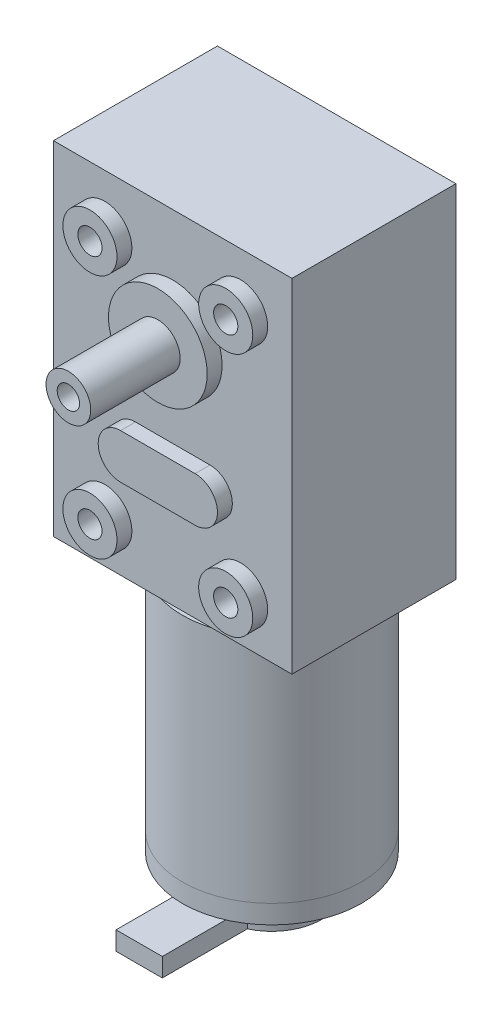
ISO-10303-21;
HEADER;
FILE_DESCRIPTION(('STEP AP214'),'2;1');
FILE_NAME('part.step','',(''),(''),'','','');
FILE_SCHEMA(('AUTOMOTIVE_DESIGN { 1 0 10303 214 1 1 1 1 }'));
ENDSEC;
DATA;
#1=APPLICATION_CONTEXT('core data for automotive mechanical design processes');
#2=APPLICATION_PROTOCOL_DEFINITION('international standard','automotive_design',2000,#1);
#3=PRODUCT_CONTEXT('',#1,'mechanical');
#4=PRODUCT('Part','Part','',(#3));
#5=PRODUCT_RELATED_PRODUCT_CATEGORY('part','',(#4));
#6=PRODUCT_DEFINITION_FORMATION('','',#4);
#7=PRODUCT_DEFINITION_CONTEXT('part definition',#1,'design');
#8=PRODUCT_DEFINITION('design','',#6,#7);
#9=PRODUCT_DEFINITION_SHAPE('','',#8);
#10=(LENGTH_UNIT() NAMED_UNIT(*) SI_UNIT(.MILLI.,.METRE.));
#11=(NAMED_UNIT(*) PLANE_ANGLE_UNIT() SI_UNIT($,.RADIAN.));
#12=(NAMED_UNIT(*) SI_UNIT($,.STERADIAN.) SOLID_ANGLE_UNIT());
#13=UNCERTAINTY_MEASURE_WITH_UNIT(LENGTH_MEASURE(1.E-05),#10,'distance_accuracy_value','');
#14=(GEOMETRIC_REPRESENTATION_CONTEXT(3) GLOBAL_UNCERTAINTY_ASSIGNED_CONTEXT((#13)) GLOBAL_UNIT_ASSIGNED_CONTEXT((#10,
#11,#12)) REPRESENTATION_CONTEXT('',''));
#15=CARTESIAN_POINT('',(0.,0.,0.));
#16=DIRECTION('',(0.,0.,1.));
#17=DIRECTION('',(1.,0.,0.));
#18=AXIS2_PLACEMENT_3D('',#15,#16,#17);
#19=CARTESIAN_POINT('',(0.,-61.,-6.));
#20=DIRECTION('',(0.,-1.,0.));
#21=DIRECTION('',(0.,0.,-1.));
#22=AXIS2_PLACEMENT_3D('',#19,#20,#21);
#23=PLANE('',#22);
#24=DIRECTION('',(0.,0.,1.));
#25=VECTOR('',#24,1.);
#26=CARTESIAN_POINT('',(4.6,-61.,-6.));
#27=LINE('',#26,#25);
#28=CARTESIAN_POINT('',(4.6,-61.,-6.));
#29=VERTEX_POINT('',#28);
#30=CARTESIAN_POINT('',(4.6,-61.,6.));
#31=VERTEX_POINT('',#30);
#32=EDGE_CURVE('E285',#29,#31,#27,.T.);
#33=ORIENTED_EDGE('',*,*,#32,.T.);
#34=DIRECTION('',(1.,0.,0.));
#35=VECTOR('',#34,1.);
#36=CARTESIAN_POINT('',(0.,-61.,6.));
#37=LINE('',#36,#35);
#38=CARTESIAN_POINT('',(-1.6,-61.,6.));
#39=VERTEX_POINT('',#38);
#40=EDGE_CURVE('E322',#39,#31,#37,.T.);
#41=ORIENTED_EDGE('',*,*,#40,.F.);
#42=DIRECTION('',(0.,0.,1.));
#43=VECTOR('',#42,1.);
#44=CARTESIAN_POINT('',(-1.6,-61.,-6.));
#45=LINE('',#44,#43);
#46=CARTESIAN_POINT('',(-1.6,-61.,-6.));
#47=VERTEX_POINT('',#46);
#48=EDGE_CURVE('E13',#47,#39,#45,.T.);
#49=ORIENTED_EDGE('',*,*,#48,.F.);
#50=DIRECTION('',(1.,0.,0.));
#51=VECTOR('',#50,1.);
#52=CARTESIAN_POINT('',(0.,-61.,-6.));
#53=LINE('',#52,#51);
#54=EDGE_CURVE('E324',#47,#29,#53,.T.);
#55=ORIENTED_EDGE('',*,*,#54,.T.);
#56=EDGE_LOOP('',(#33,#41,#49,#55));
#57=FACE_BOUND('',#56,.T.);
#58=ADVANCED_FACE('F282',(#57),#23,.T.);
#59=CARTESIAN_POINT('',(-1.6,0.,-6.));
#60=DIRECTION('',(1.,0.,0.));
#61=DIRECTION('',(0.,0.,-1.));
#62=AXIS2_PLACEMENT_3D('',#59,#60,#61);
#63=PLANE('',#62);
#64=ORIENTED_EDGE('',*,*,#48,.T.);
#65=DIRECTION('',(0.,1.,0.));
#66=VECTOR('',#65,1.);
#67=CARTESIAN_POINT('',(-1.6,0.,6.));
#68=LINE('',#67,#66);
#69=CARTESIAN_POINT('',(-1.6,-58.5,6.));
#70=VERTEX_POINT('',#69);
#71=EDGE_CURVE('E340',#39,#70,#68,.T.);
#72=ORIENTED_EDGE('',*,*,#71,.T.);
#73=DIRECTION('',(0.,0.,1.));
#74=VECTOR('',#73,1.);
#75=CARTESIAN_POINT('',(-1.6,-58.5,-6.));
#76=LINE('',#75,#74);
#77=CARTESIAN_POINT('',(-1.6,-58.5,-6.));
#78=VERTEX_POINT('',#77);
#79=EDGE_CURVE('E290',#78,#70,#76,.T.);
#80=ORIENTED_EDGE('',*,*,#79,.F.);
#81=DIRECTION('',(0.,1.,0.));
#82=VECTOR('',#81,1.);
#83=CARTESIAN_POINT('',(-1.6,0.,-6.));
#84=LINE('',#83,#82);
#85=EDGE_CURVE('E303',#47,#78,#84,.T.);
#86=ORIENTED_EDGE('',*,*,#85,.F.);
#87=EDGE_LOOP('',(#64,#72,#80,#86));
#88=FACE_BOUND('',#87,.T.);
#89=ADVANCED_FACE('F355',(#88),#63,.F.);
#90=CARTESIAN_POINT('',(0.,-58.5,-6.));
#91=DIRECTION('',(0.,-1.,0.));
#92=DIRECTION('',(0.,0.,-1.));
#93=AXIS2_PLACEMENT_3D('',#90,#91,#92);
#94=PLANE('',#93);
#95=ORIENTED_EDGE('',*,*,#79,.T.);
#96=DIRECTION('',(1.,0.,0.));
#97=VECTOR('',#96,1.);
#98=CARTESIAN_POINT('',(0.,-58.5,6.));
#99=LINE('',#98,#97);
#100=CARTESIAN_POINT('',(4.6,-58.5,6.));
#101=VERTEX_POINT('',#100);
#102=EDGE_CURVE('E336',#70,#101,#99,.T.);
#103=ORIENTED_EDGE('',*,*,#102,.T.);
#104=DIRECTION('',(0.,0.,1.));
#105=VECTOR('',#104,1.);
#106=CARTESIAN_POINT('',(4.6,-58.5,-6.));
#107=LINE('',#106,#105);
#108=CARTESIAN_POINT('',(4.6,-58.5,-6.));
#109=VERTEX_POINT('',#108);
#110=EDGE_CURVE('E328',#109,#101,#107,.T.);
#111=ORIENTED_EDGE('',*,*,#110,.F.);
#112=DIRECTION('',(1.,0.,0.));
#113=VECTOR('',#112,1.);
#114=CARTESIAN_POINT('',(0.,-58.5,-6.));
#115=LINE('',#114,#113);
#116=EDGE_CURVE('E348',#78,#109,#115,.T.);
#117=ORIENTED_EDGE('',*,*,#116,.F.);
#118=EDGE_LOOP('',(#95,#103,#111,#117));
#119=FACE_BOUND('',#118,.T.);
#120=ADVANCED_FACE('F353',(#119),#94,.F.);
#121=CARTESIAN_POINT('',(4.6,0.,-6.));
#122=DIRECTION('',(1.,0.,0.));
#123=DIRECTION('',(0.,0.,-1.));
#124=AXIS2_PLACEMENT_3D('',#121,#122,#123);
#125=PLANE('',#124);
#126=ORIENTED_EDGE('',*,*,#110,.T.);
#127=DIRECTION('',(0.,1.,0.));
#128=VECTOR('',#127,1.);
#129=CARTESIAN_POINT('',(4.6,0.,6.));
#130=LINE('',#129,#128);
#131=EDGE_CURVE('E330',#31,#101,#130,.T.);
#132=ORIENTED_EDGE('',*,*,#131,.F.);
#133=ORIENTED_EDGE('',*,*,#32,.F.);
#134=DIRECTION('',(0.,1.,0.));
#135=VECTOR('',#134,1.);
#136=CARTESIAN_POINT('',(4.6,0.,-6.));
#137=LINE('',#136,#135);
#138=EDGE_CURVE('E346',#29,#109,#137,.T.);
#139=ORIENTED_EDGE('',*,*,#138,.T.);
#140=EDGE_LOOP('',(#126,#132,#133,#139));
#141=FACE_BOUND('',#140,.T.);
#142=ADVANCED_FACE('F331',(#141),#125,.T.);
#143=CARTESIAN_POINT('',(0.,0.,-6.));
#144=DIRECTION('',(0.,0.,1.));
#145=DIRECTION('',(1.,0.,0.));
#146=AXIS2_PLACEMENT_3D('',#143,#144,#145);
#147=PLANE('',#146);
#148=ORIENTED_EDGE('',*,*,#54,.F.);
#149=ORIENTED_EDGE('',*,*,#85,.T.);
#150=ORIENTED_EDGE('',*,*,#116,.T.);
#151=ORIENTED_EDGE('',*,*,#138,.F.);
#152=EDGE_LOOP('',(#148,#149,#150,#151));
#153=FACE_BOUND('',#152,.T.);
#154=ADVANCED_FACE('F356',(#153),#147,.F.);
#155=CARTESIAN_POINT('',(0.,0.,6.));
#156=DIRECTION('',(0.,0.,1.));
#157=DIRECTION('',(1.,0.,0.));
#158=AXIS2_PLACEMENT_3D('',#155,#156,#157);
#159=PLANE('',#158);
#160=ORIENTED_EDGE('',*,*,#40,.T.);
#161=ORIENTED_EDGE('',*,*,#131,.T.);
#162=ORIENTED_EDGE('',*,*,#102,.F.);
#163=ORIENTED_EDGE('',*,*,#71,.F.);
#164=EDGE_LOOP('',(#160,#161,#162,#163));
#165=FACE_BOUND('',#164,.T.);
#166=ADVANCED_FACE('F338',(#165),#159,.T.);
#167=CLOSED_SHELL('',(#58,#89,#120,#142,#154,#166));
#168=MANIFOLD_SOLID_BREP('B2',#167);
#169=CARTESIAN_POINT('',(1.8,-61.,-11.5));
#170=DIRECTION('',(0.,1.,0.));
#171=DIRECTION('',(0.,0.,1.));
#172=AXIS2_PLACEMENT_3D('',#169,#170,#171);
#173=CYLINDRICAL_SURFACE('',#172,6.7);
#174=CARTESIAN_POINT('',(1.8,-58.5,-11.5));
#175=DIRECTION('',(0.,-1.,0.));
#176=DIRECTION('',(0.,0.,-1.));
#177=AXIS2_PLACEMENT_3D('',#174,#175,#176);
#178=CIRCLE('',#177,6.7);
#179=CARTESIAN_POINT('',(4.6,-58.5,-5.41312888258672));
#180=VERTEX_POINT('',#179);
#181=CARTESIAN_POINT('',(-1.6,-58.5,-5.72678599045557));
#182=VERTEX_POINT('',#181);
#183=EDGE_CURVE('E280',#180,#182,#178,.T.);
#184=ORIENTED_EDGE('',*,*,#183,.F.);
#185=DIRECTION('',(0.,1.,0.));
#186=VECTOR('',#185,1.);
#187=CARTESIAN_POINT('',(4.6,-61.,-5.41312888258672));
#188=LINE('',#187,#186);
#189=CARTESIAN_POINT('',(4.6,-61.,-5.41312888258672));
#190=VERTEX_POINT('',#189);
#191=EDGE_CURVE('E471',#180,#190,#188,.F.);
#192=ORIENTED_EDGE('',*,*,#191,.T.);
#193=CARTESIAN_POINT('',(1.8,-61.,-11.5));
#194=DIRECTION('',(0.,-1.,0.));
#195=DIRECTION('',(0.,0.,-1.));
#196=AXIS2_PLACEMENT_3D('',#193,#194,#195);
#197=CIRCLE('',#196,6.7);
#198=CARTESIAN_POINT('',(-1.6,-61.,-5.72678599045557));
#199=VERTEX_POINT('',#198);
#200=EDGE_CURVE('E456',#199,#190,#197,.T.);
#201=ORIENTED_EDGE('',*,*,#200,.F.);
#202=DIRECTION('',(0.,1.,0.));
#203=VECTOR('',#202,1.);
#204=CARTESIAN_POINT('',(-1.6,-61.,-5.72678599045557));
#205=LINE('',#204,#203);
#206=EDGE_CURVE('E512',#182,#199,#205,.F.);
#207=ORIENTED_EDGE('',*,*,#206,.F.);
#208=EDGE_LOOP('',(#184,#192,#201,#207));
#209=FACE_BOUND('',#208,.T.);
#210=CARTESIAN_POINT('',(1.8,-56.5,-11.5));
#211=DIRECTION('',(0.,-1.,0.));
#212=DIRECTION('',(0.,0.,-1.));
#213=AXIS2_PLACEMENT_3D('',#210,#211,#212);
#214=CIRCLE('',#213,6.7);
#215=CARTESIAN_POINT('',(1.8,-56.5,-18.2));
#216=VERTEX_POINT('',#215);
#217=EDGE_CURVE('E518',#216,#216,#214,.T.);
#218=ORIENTED_EDGE('',*,*,#217,.T.);
#219=EDGE_LOOP('',(#218));
#220=FACE_BOUND('',#219,.T.);
#221=ADVANCED_FACE('F449',(#209,#220),#173,.T.);
#222=CARTESIAN_POINT('',(1.8,-61.,-11.5));
#223=DIRECTION('',(0.,-1.,0.));
#224=DIRECTION('',(0.,0.,-1.));
#225=AXIS2_PLACEMENT_3D('',#222,#223,#224);
#226=PLANE('',#225);
#227=DIRECTION('',(0.,0.,1.));
#228=VECTOR('',#227,1.);
#229=CARTESIAN_POINT('',(4.6,-61.,-6.));
#230=LINE('',#229,#228);
#231=CARTESIAN_POINT('',(4.6,-61.,-6.));
#232=VERTEX_POINT('',#231);
#233=EDGE_CURVE('E513',#232,#190,#230,.T.);
#234=ORIENTED_EDGE('',*,*,#233,.F.);
#235=DIRECTION('',(1.,0.,0.));
#236=VECTOR('',#235,1.);
#237=CARTESIAN_POINT('',(0.,-61.,-6.));
#238=LINE('',#237,#236);
#239=CARTESIAN_POINT('',(-1.6,-61.,-6.));
#240=VERTEX_POINT('',#239);
#241=EDGE_CURVE('E495',#240,#232,#238,.T.);
#242=ORIENTED_EDGE('',*,*,#241,.F.);
#243=DIRECTION('',(0.,0.,1.));
#244=VECTOR('',#243,1.);
#245=CARTESIAN_POINT('',(-1.6,-61.,-6.));
#246=LINE('',#245,#244);
#247=EDGE_CURVE('E493',#240,#199,#246,.T.);
#248=ORIENTED_EDGE('',*,*,#247,.T.);
#249=ORIENTED_EDGE('',*,*,#200,.T.);
#250=EDGE_LOOP('',(#234,#242,#248,#249));
#251=FACE_BOUND('',#250,.T.);
#252=ADVANCED_FACE('F526',(#251),#226,.T.);
#253=CARTESIAN_POINT('',(1.8,-56.5,-11.5));
#254=DIRECTION('',(0.,-1.,0.));
#255=DIRECTION('',(0.,0.,-1.));
#256=AXIS2_PLACEMENT_3D('',#253,#254,#255);
#257=PLANE('',#256);
#258=ORIENTED_EDGE('',*,*,#217,.F.);
#259=EDGE_LOOP('',(#258));
#260=FACE_BOUND('',#259,.T.);
#261=ADVANCED_FACE('F524',(#260),#257,.F.);
#262=CARTESIAN_POINT('',(0.,-58.5,-6.));
#263=DIRECTION('',(0.,-1.,0.));
#264=DIRECTION('',(0.,0.,-1.));
#265=AXIS2_PLACEMENT_3D('',#262,#263,#264);
#266=PLANE('',#265);
#267=ORIENTED_EDGE('',*,*,#183,.T.);
#268=DIRECTION('',(0.,0.,1.));
#269=VECTOR('',#268,1.);
#270=CARTESIAN_POINT('',(-1.6,-58.5,-6.));
#271=LINE('',#270,#269);
#272=CARTESIAN_POINT('',(-1.6,-58.5,-6.));
#273=VERTEX_POINT('',#272);
#274=EDGE_CURVE('E490',#273,#182,#271,.T.);
#275=ORIENTED_EDGE('',*,*,#274,.F.);
#276=DIRECTION('',(1.,0.,0.));
#277=VECTOR('',#276,1.);
#278=CARTESIAN_POINT('',(0.,-58.5,-6.));
#279=LINE('',#278,#277);
#280=CARTESIAN_POINT('',(4.6,-58.5,-6.));
#281=VERTEX_POINT('',#280);
#282=EDGE_CURVE('E496',#273,#281,#279,.T.);
#283=ORIENTED_EDGE('',*,*,#282,.T.);
#284=DIRECTION('',(0.,0.,1.));
#285=VECTOR('',#284,1.);
#286=CARTESIAN_POINT('',(4.6,-58.5,-6.));
#287=LINE('',#286,#285);
#288=EDGE_CURVE('E510',#281,#180,#287,.T.);
#289=ORIENTED_EDGE('',*,*,#288,.T.);
#290=EDGE_LOOP('',(#267,#275,#283,#289));
#291=FACE_BOUND('',#290,.T.);
#292=ADVANCED_FACE('F499',(#291),#266,.T.);
#293=CARTESIAN_POINT('',(4.6,0.,-6.));
#294=DIRECTION('',(1.,0.,0.));
#295=DIRECTION('',(0.,0.,-1.));
#296=AXIS2_PLACEMENT_3D('',#293,#294,#295);
#297=PLANE('',#296);
#298=ORIENTED_EDGE('',*,*,#288,.F.);
#299=DIRECTION('',(0.,1.,0.));
#300=VECTOR('',#299,1.);
#301=CARTESIAN_POINT('',(4.6,0.,-6.));
#302=LINE('',#301,#300);
#303=EDGE_CURVE('E501',#232,#281,#302,.T.);
#304=ORIENTED_EDGE('',*,*,#303,.F.);
#305=ORIENTED_EDGE('',*,*,#233,.T.);
#306=ORIENTED_EDGE('',*,*,#191,.F.);
#307=EDGE_LOOP('',(#298,#304,#305,#306));
#308=FACE_BOUND('',#307,.T.);
#309=ADVANCED_FACE('F531',(#308),#297,.F.);
#310=CARTESIAN_POINT('',(-1.6,0.,-6.));
#311=DIRECTION('',(1.,0.,0.));
#312=DIRECTION('',(0.,0.,-1.));
#313=AXIS2_PLACEMENT_3D('',#310,#311,#312);
#314=PLANE('',#313);
#315=ORIENTED_EDGE('',*,*,#206,.T.);
#316=ORIENTED_EDGE('',*,*,#247,.F.);
#317=DIRECTION('',(0.,1.,0.));
#318=VECTOR('',#317,1.);
#319=CARTESIAN_POINT('',(-1.6,0.,-6.));
#320=LINE('',#319,#318);
#321=EDGE_CURVE('E463',#240,#273,#320,.T.);
#322=ORIENTED_EDGE('',*,*,#321,.T.);
#323=ORIENTED_EDGE('',*,*,#274,.T.);
#324=EDGE_LOOP('',(#315,#316,#322,#323));
#325=FACE_BOUND('',#324,.T.);
#326=ADVANCED_FACE('F489',(#325),#314,.T.);
#327=CARTESIAN_POINT('',(0.,0.,-6.));
#328=DIRECTION('',(0.,0.,1.));
#329=DIRECTION('',(1.,0.,0.));
#330=AXIS2_PLACEMENT_3D('',#327,#328,#329);
#331=PLANE('',#330);
#332=ORIENTED_EDGE('',*,*,#282,.F.);
#333=ORIENTED_EDGE('',*,*,#321,.F.);
#334=ORIENTED_EDGE('',*,*,#241,.T.);
#335=ORIENTED_EDGE('',*,*,#303,.T.);
#336=EDGE_LOOP('',(#332,#333,#334,#335));
#337=FACE_BOUND('',#336,.T.);
#338=ADVANCED_FACE('F504',(#337),#331,.T.);
#339=CLOSED_SHELL('',(#221,#252,#261,#292,#309,#326,#338));
#340=MANIFOLD_SOLID_BREP('B7',#339);
#341=CARTESIAN_POINT('',(1.8,-56.5,-11.5));
#342=DIRECTION('',(0.,1.,0.));
#343=DIRECTION('',(0.,0.,1.));
#344=AXIS2_PLACEMENT_3D('',#341,#342,#343);
#345=CYLINDRICAL_SURFACE('',#344,12.);
#346=CARTESIAN_POINT('',(1.8,-56.5,-11.5));
#347=DIRECTION('',(0.,-1.,0.));
#348=DIRECTION('',(0.,0.,-1.));
#349=AXIS2_PLACEMENT_3D('',#346,#347,#348);
#350=CIRCLE('',#349,12.);
#351=CARTESIAN_POINT('',(1.8,-56.5,-23.5));
#352=VERTEX_POINT('',#351);
#353=EDGE_CURVE('E448',#352,#352,#350,.T.);
#354=ORIENTED_EDGE('',*,*,#353,.F.);
#355=EDGE_LOOP('',(#354));
#356=FACE_BOUND('',#355,.T.);
#357=CARTESIAN_POINT('',(1.8,-54.,-11.5));
#358=DIRECTION('',(0.,-1.,0.));
#359=DIRECTION('',(0.,0.,-1.));
#360=AXIS2_PLACEMENT_3D('',#357,#358,#359);
#361=CIRCLE('',#360,12.);
#362=CARTESIAN_POINT('',(1.8,-54.,-23.5));
#363=VERTEX_POINT('',#362);
#364=EDGE_CURVE('E624',#363,#363,#361,.T.);
#365=ORIENTED_EDGE('',*,*,#364,.T.);
#366=EDGE_LOOP('',(#365));
#367=FACE_BOUND('',#366,.T.);
#368=ADVANCED_FACE('F621',(#356,#367),#345,.T.);
#369=CARTESIAN_POINT('',(1.8,-56.5,-11.5));
#370=DIRECTION('',(0.,-1.,0.));
#371=DIRECTION('',(0.,0.,-1.));
#372=AXIS2_PLACEMENT_3D('',#369,#370,#371);
#373=PLANE('',#372);
#374=ORIENTED_EDGE('',*,*,#353,.T.);
#375=EDGE_LOOP('',(#374));
#376=FACE_BOUND('',#375,.T.);
#377=ADVANCED_FACE('F636',(#376),#373,.T.);
#378=CARTESIAN_POINT('',(1.8,-54.,-11.5));
#379=DIRECTION('',(0.,-1.,0.));
#380=DIRECTION('',(0.,0.,-1.));
#381=AXIS2_PLACEMENT_3D('',#378,#379,#380);
#382=PLANE('',#381);
#383=ORIENTED_EDGE('',*,*,#364,.F.);
#384=EDGE_LOOP('',(#383));
#385=FACE_BOUND('',#384,.T.);
#386=ADVANCED_FACE('F634',(#385),#382,.F.);
#387=CLOSED_SHELL('',(#368,#377,#386));
#388=MANIFOLD_SOLID_BREP('B274',#387);
#389=CARTESIAN_POINT('',(1.8,-54.,-11.5));
#390=DIRECTION('',(0.,1.,0.));
#391=DIRECTION('',(0.,0.,1.));
#392=AXIS2_PLACEMENT_3D('',#389,#390,#391);
#393=CYLINDRICAL_SURFACE('',#392,12.);
#394=CARTESIAN_POINT('',(1.8,-54.,-11.5));
#395=DIRECTION('',(0.,-1.,0.));
#396=DIRECTION('',(0.,0.,-1.));
#397=AXIS2_PLACEMENT_3D('',#394,#395,#396);
#398=CIRCLE('',#397,12.);
#399=CARTESIAN_POINT('',(1.8,-54.,-23.5));
#400=VERTEX_POINT('',#399);
#401=EDGE_CURVE('E620',#400,#400,#398,.T.);
#402=ORIENTED_EDGE('',*,*,#401,.F.);
#403=EDGE_LOOP('',(#402));
#404=FACE_BOUND('',#403,.T.);
#405=CARTESIAN_POINT('',(1.8,-23.,-11.5));
#406=DIRECTION('',(0.,-1.,0.));
#407=DIRECTION('',(0.,0.,-1.));
#408=AXIS2_PLACEMENT_3D('',#405,#406,#407);
#409=CIRCLE('',#408,12.);
#410=CARTESIAN_POINT('',(1.8,-23.,-23.5));
#411=VERTEX_POINT('',#410);
#412=EDGE_CURVE('E679',#411,#411,#409,.T.);
#413=ORIENTED_EDGE('',*,*,#412,.T.);
#414=EDGE_LOOP('',(#413));
#415=FACE_BOUND('',#414,.T.);
#416=ADVANCED_FACE('F676',(#404,#415),#393,.T.);
#417=CARTESIAN_POINT('',(1.8,-54.,-11.5));
#418=DIRECTION('',(0.,-1.,0.));
#419=DIRECTION('',(0.,0.,-1.));
#420=AXIS2_PLACEMENT_3D('',#417,#418,#419);
#421=PLANE('',#420);
#422=ORIENTED_EDGE('',*,*,#401,.T.);
#423=EDGE_LOOP('',(#422));
#424=FACE_BOUND('',#423,.T.);
#425=ADVANCED_FACE('F691',(#424),#421,.T.);
#426=CARTESIAN_POINT('',(1.8,-23.,-11.5));
#427=DIRECTION('',(0.,-1.,0.));
#428=DIRECTION('',(0.,0.,-1.));
#429=AXIS2_PLACEMENT_3D('',#426,#427,#428);
#430=PLANE('',#429);
#431=ORIENTED_EDGE('',*,*,#412,.F.);
#432=EDGE_LOOP('',(#431));
#433=FACE_BOUND('',#432,.T.);
#434=ADVANCED_FACE('F689',(#433),#430,.F.);
#435=CLOSED_SHELL('',(#416,#425,#434));
#436=MANIFOLD_SOLID_BREP('B443',#435);
#437=CARTESIAN_POINT('',(9.11,15.77,-12.));
#438=DIRECTION('',(0.,0.,1.));
#439=DIRECTION('',(1.,0.,0.));
#440=AXIS2_PLACEMENT_3D('',#437,#438,#439);
#441=CYLINDRICAL_SURFACE('',#440,1.625);
#442=CARTESIAN_POINT('',(9.11,15.77,-12.));
#443=DIRECTION('',(0.,0.,1.));
#444=DIRECTION('',(1.,0.,0.));
#445=AXIS2_PLACEMENT_3D('',#442,#443,#444);
#446=CIRCLE('',#445,1.625);
#447=CARTESIAN_POINT('',(10.735,15.77,-12.));
#448=VERTEX_POINT('',#447);
#449=EDGE_CURVE('E962',#448,#448,#446,.T.);
#450=ORIENTED_EDGE('',*,*,#449,.F.);
#451=EDGE_LOOP('',(#450));
#452=FACE_BOUND('',#451,.T.);
#453=CARTESIAN_POINT('',(9.11,15.77,2.));
#454=DIRECTION('',(0.,0.,1.));
#455=DIRECTION('',(1.,0.,0.));
#456=AXIS2_PLACEMENT_3D('',#453,#454,#455);
#457=CIRCLE('',#456,1.625);
#458=CARTESIAN_POINT('',(10.735,15.77,2.));
#459=VERTEX_POINT('',#458);
#460=EDGE_CURVE('E967',#459,#459,#457,.F.);
#461=ORIENTED_EDGE('',*,*,#460,.F.);
#462=EDGE_LOOP('',(#461));
#463=FACE_BOUND('',#462,.T.);
#464=ADVANCED_FACE('F740',(#452,#463),#441,.F.);
#465=CARTESIAN_POINT('',(9.11,15.77,-12.));
#466=DIRECTION('',(0.,0.,1.));
#467=DIRECTION('',(1.,0.,0.));
#468=AXIS2_PLACEMENT_3D('',#465,#466,#467);
#469=PLANE('',#468);
#470=ORIENTED_EDGE('',*,*,#449,.T.);
#471=EDGE_LOOP('',(#470));
#472=FACE_BOUND('',#471,.T.);
#473=ADVANCED_FACE('F986',(#472),#469,.T.);
#474=CARTESIAN_POINT('',(0.,0.,0.));
#475=DIRECTION('',(0.,0.,1.));
#476=DIRECTION('',(1.,0.,0.));
#477=AXIS2_PLACEMENT_3D('',#474,#475,#476);
#478=PLANE('',#477);
#479=CARTESIAN_POINT('',(0.,8.2,0.));
#480=DIRECTION('',(0.,0.,1.));
#481=DIRECTION('',(1.,0.,0.));
#482=AXIS2_PLACEMENT_3D('',#479,#480,#481);
#483=CIRCLE('',#482,6.62);
#484=CARTESIAN_POINT('',(6.62,8.2,0.));
#485=VERTEX_POINT('',#484);
#486=EDGE_CURVE('E946',#485,#485,#483,.T.);
#487=ORIENTED_EDGE('',*,*,#486,.F.);
#488=EDGE_LOOP('',(#487));
#489=FACE_BOUND('',#488,.T.);
#490=CARTESIAN_POINT('',(-9.11000000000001,-17.13,0.));
#491=DIRECTION('',(0.,0.,1.));
#492=DIRECTION('',(1.,0.,0.));
#493=AXIS2_PLACEMENT_3D('',#490,#491,#492);
#494=CIRCLE('',#493,3.63);
#495=CARTESIAN_POINT('',(-5.48000000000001,-17.13,0.));
#496=VERTEX_POINT('',#495);
#497=EDGE_CURVE('E850',#496,#496,#494,.F.);
#498=ORIENTED_EDGE('',*,*,#497,.T.);
#499=EDGE_LOOP('',(#498));
#500=FACE_BOUND('',#499,.T.);
#501=CARTESIAN_POINT('',(9.11,-17.13,0.));
#502=DIRECTION('',(0.,0.,1.));
#503=DIRECTION('',(1.,0.,0.));
#504=AXIS2_PLACEMENT_3D('',#501,#502,#503);
#505=CIRCLE('',#504,3.63);
#506=CARTESIAN_POINT('',(12.74,-17.13,0.));
#507=VERTEX_POINT('',#506);
#508=EDGE_CURVE('E674',#507,#507,#505,.T.);
#509=ORIENTED_EDGE('',*,*,#508,.F.);
#510=EDGE_LOOP('',(#509));
#511=FACE_BOUND('',#510,.T.);
#512=CARTESIAN_POINT('',(-9.11,15.77,0.));
#513=DIRECTION('',(0.,0.,1.));
#514=DIRECTION('',(1.,0.,0.));
#515=AXIS2_PLACEMENT_3D('',#512,#513,#514);
#516=CIRCLE('',#515,3.63);
#517=CARTESIAN_POINT('',(-5.48,15.77,0.));
#518=VERTEX_POINT('',#517);
#519=EDGE_CURVE('E874',#518,#518,#516,.F.);
#520=ORIENTED_EDGE('',*,*,#519,.T.);
#521=EDGE_LOOP('',(#520));
#522=FACE_BOUND('',#521,.T.);
#523=CARTESIAN_POINT('',(9.11,15.77,0.));
#524=DIRECTION('',(0.,0.,1.));
#525=DIRECTION('',(1.,0.,0.));
#526=AXIS2_PLACEMENT_3D('',#523,#524,#525);
#527=CIRCLE('',#526,3.63);
#528=CARTESIAN_POINT('',(12.74,15.77,0.));
#529=VERTEX_POINT('',#528);
#530=EDGE_CURVE('E744',#529,#529,#527,.T.);
#531=ORIENTED_EDGE('',*,*,#530,.F.);
#532=EDGE_LOOP('',(#531));
#533=FACE_BOUND('',#532,.T.);
#534=DIRECTION('',(1.,0.,0.));
#535=VECTOR('',#534,1.);
#536=CARTESIAN_POINT('',(0.,-10.1875,0.));
#537=LINE('',#536,#535);
#538=CARTESIAN_POINT('',(-5.,-10.1875,0.));
#539=VERTEX_POINT('',#538);
#540=CARTESIAN_POINT('',(5.,-10.1875,0.));
#541=VERTEX_POINT('',#540);
#542=EDGE_CURVE('E906',#539,#541,#537,.T.);
#543=ORIENTED_EDGE('',*,*,#542,.F.);
#544=CARTESIAN_POINT('',(-5.,-7.18749999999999,0.));
#545=DIRECTION('',(0.,0.,1.));
#546=DIRECTION('',(1.,0.,0.));
#547=AXIS2_PLACEMENT_3D('',#544,#545,#546);
#548=CIRCLE('',#547,3.);
#549=CARTESIAN_POINT('',(-5.,-4.1875,0.));
#550=VERTEX_POINT('',#549);
#551=EDGE_CURVE('E762',#550,#539,#548,.T.);
#552=ORIENTED_EDGE('',*,*,#551,.F.);
#553=DIRECTION('',(1.,0.,0.));
#554=VECTOR('',#553,1.);
#555=CARTESIAN_POINT('',(0.,-4.1875,0.));
#556=LINE('',#555,#554);
#557=CARTESIAN_POINT('',(5.,-4.1875,0.));
#558=VERTEX_POINT('',#557);
#559=EDGE_CURVE('E757',#550,#558,#556,.T.);
#560=ORIENTED_EDGE('',*,*,#559,.T.);
#561=CARTESIAN_POINT('',(5.,-7.18749999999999,0.));
#562=DIRECTION('',(0.,0.,1.));
#563=DIRECTION('',(1.,0.,0.));
#564=AXIS2_PLACEMENT_3D('',#561,#562,#563);
#565=CIRCLE('',#564,3.);
#566=EDGE_CURVE('E923',#541,#558,#565,.T.);
#567=ORIENTED_EDGE('',*,*,#566,.F.);
#568=EDGE_LOOP('',(#543,#552,#560,#567));
#569=FACE_BOUND('',#568,.T.);
#570=DIRECTION('',(1.,0.,0.));
#571=VECTOR('',#570,1.);
#572=CARTESIAN_POINT('',(-16.,23.,0.));
#573=LINE('',#572,#571);
#574=CARTESIAN_POINT('',(-16.,23.,0.));
#575=VERTEX_POINT('',#574);
#576=CARTESIAN_POINT('',(16.,23.,0.));
#577=VERTEX_POINT('',#576);
#578=EDGE_CURVE('E878',#575,#577,#573,.T.);
#579=ORIENTED_EDGE('',*,*,#578,.F.);
#580=DIRECTION('',(0.,1.,0.));
#581=VECTOR('',#580,1.);
#582=CARTESIAN_POINT('',(-16.,-23.,0.));
#583=LINE('',#582,#581);
#584=CARTESIAN_POINT('',(-16.,-23.,0.));
#585=VERTEX_POINT('',#584);
#586=EDGE_CURVE('E887',#585,#575,#583,.T.);
#587=ORIENTED_EDGE('',*,*,#586,.F.);
#588=DIRECTION('',(1.,0.,0.));
#589=VECTOR('',#588,1.);
#590=CARTESIAN_POINT('',(-16.,-23.,0.));
#591=LINE('',#590,#589);
#592=CARTESIAN_POINT('',(16.,-23.,0.));
#593=VERTEX_POINT('',#592);
#594=EDGE_CURVE('E898',#585,#593,#591,.T.);
#595=ORIENTED_EDGE('',*,*,#594,.T.);
#596=DIRECTION('',(0.,1.,0.));
#597=VECTOR('',#596,1.);
#598=CARTESIAN_POINT('',(16.,-23.,0.));
#599=LINE('',#598,#597);
#600=EDGE_CURVE('E902',#593,#577,#599,.T.);
#601=ORIENTED_EDGE('',*,*,#600,.T.);
#602=EDGE_LOOP('',(#579,#587,#595,#601));
#603=FACE_BOUND('',#602,.T.);
#604=ADVANCED_FACE('F992',(#489,#500,#511,#522,#533,#569,#603),#478,.T.);
#605=CARTESIAN_POINT('',(0.,0.,-22.));
#606=DIRECTION('',(0.,0.,1.));
#607=DIRECTION('',(1.,0.,0.));
#608=AXIS2_PLACEMENT_3D('',#605,#606,#607);
#609=PLANE('',#608);
#610=DIRECTION('',(1.,0.,0.));
#611=VECTOR('',#610,1.);
#612=CARTESIAN_POINT('',(-16.,23.,-22.));
#613=LINE('',#612,#611);
#614=CARTESIAN_POINT('',(-16.,23.,-22.));
#615=VERTEX_POINT('',#614);
#616=CARTESIAN_POINT('',(16.,23.,-22.));
#617=VERTEX_POINT('',#616);
#618=EDGE_CURVE('E891',#615,#617,#613,.T.);
#619=ORIENTED_EDGE('',*,*,#618,.T.);
#620=DIRECTION('',(0.,1.,0.));
#621=VECTOR('',#620,1.);
#622=CARTESIAN_POINT('',(16.,-23.,-22.));
#623=LINE('',#622,#621);
#624=CARTESIAN_POINT('',(16.,-23.,-22.));
#625=VERTEX_POINT('',#624);
#626=EDGE_CURVE('E883',#625,#617,#623,.T.);
#627=ORIENTED_EDGE('',*,*,#626,.F.);
#628=DIRECTION('',(1.,0.,0.));
#629=VECTOR('',#628,1.);
#630=CARTESIAN_POINT('',(-16.,-23.,-22.));
#631=LINE('',#630,#629);
#632=CARTESIAN_POINT('',(-16.,-23.,-22.));
#633=VERTEX_POINT('',#632);
#634=EDGE_CURVE('E882',#633,#625,#631,.T.);
#635=ORIENTED_EDGE('',*,*,#634,.F.);
#636=DIRECTION('',(0.,1.,0.));
#637=VECTOR('',#636,1.);
#638=CARTESIAN_POINT('',(-16.,-23.,-22.));
#639=LINE('',#638,#637);
#640=EDGE_CURVE('E910',#633,#615,#639,.T.);
#641=ORIENTED_EDGE('',*,*,#640,.T.);
#642=EDGE_LOOP('',(#619,#627,#635,#641));
#643=FACE_BOUND('',#642,.T.);
#644=ADVANCED_FACE('F995',(#643),#609,.F.);
#645=CARTESIAN_POINT('',(16.,-23.,-22.));
#646=DIRECTION('',(1.,0.,0.));
#647=DIRECTION('',(0.,0.,-1.));
#648=AXIS2_PLACEMENT_3D('',#645,#646,#647);
#649=PLANE('',#648);
#650=ORIENTED_EDGE('',*,*,#600,.F.);
#651=DIRECTION('',(0.,0.,1.));
#652=VECTOR('',#651,1.);
#653=CARTESIAN_POINT('',(16.,-23.,-22.));
#654=LINE('',#653,#652);
#655=EDGE_CURVE('E884',#625,#593,#654,.T.);
#656=ORIENTED_EDGE('',*,*,#655,.F.);
#657=ORIENTED_EDGE('',*,*,#626,.T.);
#658=DIRECTION('',(0.,0.,1.));
#659=VECTOR('',#658,1.);
#660=CARTESIAN_POINT('',(16.,23.,-22.));
#661=LINE('',#660,#659);
#662=EDGE_CURVE('E879',#617,#577,#661,.T.);
#663=ORIENTED_EDGE('',*,*,#662,.T.);
#664=EDGE_LOOP('',(#650,#656,#657,#663));
#665=FACE_BOUND('',#664,.T.);
#666=ADVANCED_FACE('F1081',(#665),#649,.T.);
#667=CARTESIAN_POINT('',(-16.,-23.,-22.));
#668=DIRECTION('',(0.,-1.,0.));
#669=DIRECTION('',(0.,0.,-1.));
#670=AXIS2_PLACEMENT_3D('',#667,#668,#669);
#671=PLANE('',#670);
#672=ORIENTED_EDGE('',*,*,#594,.F.);
#673=DIRECTION('',(0.,0.,1.));
#674=VECTOR('',#673,1.);
#675=CARTESIAN_POINT('',(-16.,-23.,-22.));
#676=LINE('',#675,#674);
#677=EDGE_CURVE('E888',#633,#585,#676,.T.);
#678=ORIENTED_EDGE('',*,*,#677,.F.);
#679=ORIENTED_EDGE('',*,*,#634,.T.);
#680=ORIENTED_EDGE('',*,*,#655,.T.);
#681=EDGE_LOOP('',(#672,#678,#679,#680));
#682=FACE_BOUND('',#681,.T.);
#683=ADVANCED_FACE('F1090',(#682),#671,.T.);
#684=CARTESIAN_POINT('',(-16.,-23.,-22.));
#685=DIRECTION('',(1.,0.,0.));
#686=DIRECTION('',(0.,0.,-1.));
#687=AXIS2_PLACEMENT_3D('',#684,#685,#686);
#688=PLANE('',#687);
#689=ORIENTED_EDGE('',*,*,#586,.T.);
#690=DIRECTION('',(0.,0.,1.));
#691=VECTOR('',#690,1.);
#692=CARTESIAN_POINT('',(-16.,23.,-22.));
#693=LINE('',#692,#691);
#694=EDGE_CURVE('E892',#615,#575,#693,.T.);
#695=ORIENTED_EDGE('',*,*,#694,.F.);
#696=ORIENTED_EDGE('',*,*,#640,.F.);
#697=ORIENTED_EDGE('',*,*,#677,.T.);
#698=EDGE_LOOP('',(#689,#695,#696,#697));
#699=FACE_BOUND('',#698,.T.);
#700=ADVANCED_FACE('F742',(#699),#688,.F.);
#701=CARTESIAN_POINT('',(-16.,23.,-22.));
#702=DIRECTION('',(0.,-1.,0.));
#703=DIRECTION('',(1.,0.,0.));
#704=AXIS2_PLACEMENT_3D('',#701,#702,#703);
#705=PLANE('',#704);
#706=ORIENTED_EDGE('',*,*,#578,.T.);
#707=ORIENTED_EDGE('',*,*,#662,.F.);
#708=ORIENTED_EDGE('',*,*,#618,.F.);
#709=ORIENTED_EDGE('',*,*,#694,.T.);
#710=EDGE_LOOP('',(#706,#707,#708,#709));
#711=FACE_BOUND('',#710,.T.);
#712=ADVANCED_FACE('F1077',(#711),#705,.F.);
#713=CARTESIAN_POINT('',(-9.11,15.77,-22.));
#714=DIRECTION('',(0.,0.,1.));
#715=DIRECTION('',(1.,0.,0.));
#716=AXIS2_PLACEMENT_3D('',#713,#714,#715);
#717=CYLINDRICAL_SURFACE('',#716,3.63);
#718=ORIENTED_EDGE('',*,*,#519,.F.);
#719=EDGE_LOOP('',(#718));
#720=FACE_BOUND('',#719,.T.);
#721=CARTESIAN_POINT('',(-9.11,15.77,2.));
#722=DIRECTION('',(0.,0.,1.));
#723=DIRECTION('',(1.,0.,0.));
#724=AXIS2_PLACEMENT_3D('',#721,#722,#723);
#725=CIRCLE('',#724,3.63);
#726=CARTESIAN_POINT('',(-5.48,15.77,2.));
#727=VERTEX_POINT('',#726);
#728=EDGE_CURVE('E866',#727,#727,#725,.F.);
#729=ORIENTED_EDGE('',*,*,#728,.T.);
#730=EDGE_LOOP('',(#729));
#731=FACE_BOUND('',#730,.T.);
#732=ADVANCED_FACE('F1073',(#720,#731),#717,.T.);
#733=CARTESIAN_POINT('',(-9.11,15.77,-22.));
#734=DIRECTION('',(0.,0.,1.));
#735=DIRECTION('',(1.,0.,0.));
#736=AXIS2_PLACEMENT_3D('',#733,#734,#735);
#737=CYLINDRICAL_SURFACE('',#736,1.625);
#738=CARTESIAN_POINT('',(-9.11,15.77,2.));
#739=DIRECTION('',(0.,0.,1.));
#740=DIRECTION('',(1.,0.,0.));
#741=AXIS2_PLACEMENT_3D('',#738,#739,#740);
#742=CIRCLE('',#741,1.625);
#743=CARTESIAN_POINT('',(-7.485,15.77,2.));
#744=VERTEX_POINT('',#743);
#745=EDGE_CURVE('E870',#744,#744,#742,.F.);
#746=ORIENTED_EDGE('',*,*,#745,.F.);
#747=EDGE_LOOP('',(#746));
#748=FACE_BOUND('',#747,.T.);
#749=CARTESIAN_POINT('',(-9.11,15.77,-12.));
#750=DIRECTION('',(0.,0.,1.));
#751=DIRECTION('',(1.,0.,0.));
#752=AXIS2_PLACEMENT_3D('',#749,#750,#751);
#753=CIRCLE('',#752,1.625);
#754=CARTESIAN_POINT('',(-7.485,15.77,-12.));
#755=VERTEX_POINT('',#754);
#756=EDGE_CURVE('E951',#755,#755,#753,.F.);
#757=ORIENTED_EDGE('',*,*,#756,.T.);
#758=EDGE_LOOP('',(#757));
#759=FACE_BOUND('',#758,.T.);
#760=ADVANCED_FACE('F1069',(#748,#759),#737,.F.);
#761=CARTESIAN_POINT('',(0.,0.,2.));
#762=DIRECTION('',(0.,0.,1.));
#763=DIRECTION('',(1.,0.,0.));
#764=AXIS2_PLACEMENT_3D('',#761,#762,#763);
#765=PLANE('',#764);
#766=ORIENTED_EDGE('',*,*,#728,.F.);
#767=EDGE_LOOP('',(#766));
#768=FACE_BOUND('',#767,.T.);
#769=ORIENTED_EDGE('',*,*,#745,.T.);
#770=EDGE_LOOP('',(#769));
#771=FACE_BOUND('',#770,.T.);
#772=ADVANCED_FACE('F1066',(#768,#771),#765,.T.);
#773=CARTESIAN_POINT('',(0.,0.,2.));
#774=DIRECTION('',(0.,0.,1.));
#775=DIRECTION('',(1.,0.,0.));
#776=AXIS2_PLACEMENT_3D('',#773,#774,#775);
#777=PLANE('',#776);
#778=ORIENTED_EDGE('',*,*,#460,.T.);
#779=EDGE_LOOP('',(#778));
#780=FACE_BOUND('',#779,.T.);
#781=CARTESIAN_POINT('',(9.11,15.77,2.));
#782=DIRECTION('',(0.,0.,1.));
#783=DIRECTION('',(1.,0.,0.));
#784=AXIS2_PLACEMENT_3D('',#781,#782,#783);
#785=CIRCLE('',#784,3.63);
#786=CARTESIAN_POINT('',(12.74,15.77,2.));
#787=VERTEX_POINT('',#786);
#788=EDGE_CURVE('E861',#787,#787,#785,.T.);
#789=ORIENTED_EDGE('',*,*,#788,.T.);
#790=EDGE_LOOP('',(#789));
#791=FACE_BOUND('',#790,.T.);
#792=ADVANCED_FACE('F982',(#780,#791),#777,.T.);
#793=CARTESIAN_POINT('',(9.11,15.77,-22.));
#794=DIRECTION('',(0.,0.,1.));
#795=DIRECTION('',(1.,0.,0.));
#796=AXIS2_PLACEMENT_3D('',#793,#794,#795);
#797=CYLINDRICAL_SURFACE('',#796,3.63);
#798=ORIENTED_EDGE('',*,*,#530,.T.);
#799=EDGE_LOOP('',(#798));
#800=FACE_BOUND('',#799,.T.);
#801=ORIENTED_EDGE('',*,*,#788,.F.);
#802=EDGE_LOOP('',(#801));
#803=FACE_BOUND('',#802,.T.);
#804=ADVANCED_FACE('F1053',(#800,#803),#797,.T.);
#805=CARTESIAN_POINT('',(9.11,-17.13,-22.));
#806=DIRECTION('',(0.,0.,1.));
#807=DIRECTION('',(1.,0.,0.));
#808=AXIS2_PLACEMENT_3D('',#805,#806,#807);
#809=CYLINDRICAL_SURFACE('',#808,1.625);
#810=CARTESIAN_POINT('',(9.11,-17.13,2.));
#811=DIRECTION('',(0.,0.,1.));
#812=DIRECTION('',(1.,0.,0.));
#813=AXIS2_PLACEMENT_3D('',#810,#811,#812);
#814=CIRCLE('',#813,1.625);
#815=CARTESIAN_POINT('',(10.735,-17.13,2.));
#816=VERTEX_POINT('',#815);
#817=EDGE_CURVE('E858',#816,#816,#814,.T.);
#818=ORIENTED_EDGE('',*,*,#817,.T.);
#819=EDGE_LOOP('',(#818));
#820=FACE_BOUND('',#819,.T.);
#821=CARTESIAN_POINT('',(9.11,-17.13,-12.));
#822=DIRECTION('',(0.,0.,1.));
#823=DIRECTION('',(1.,0.,0.));
#824=AXIS2_PLACEMENT_3D('',#821,#822,#823);
#825=CIRCLE('',#824,1.625);
#826=CARTESIAN_POINT('',(10.735,-17.13,-12.));
#827=VERTEX_POINT('',#826);
#828=EDGE_CURVE('E966',#827,#827,#825,.T.);
#829=ORIENTED_EDGE('',*,*,#828,.F.);
#830=EDGE_LOOP('',(#829));
#831=FACE_BOUND('',#830,.T.);
#832=ADVANCED_FACE('F1049',(#820,#831),#809,.F.);
#833=CARTESIAN_POINT('',(9.11,-17.13,-22.));
#834=DIRECTION('',(0.,0.,1.));
#835=DIRECTION('',(1.,0.,0.));
#836=AXIS2_PLACEMENT_3D('',#833,#834,#835);
#837=CYLINDRICAL_SURFACE('',#836,3.63);
#838=ORIENTED_EDGE('',*,*,#508,.T.);
#839=EDGE_LOOP('',(#838));
#840=FACE_BOUND('',#839,.T.);
#841=CARTESIAN_POINT('',(9.11,-17.13,2.));
#842=DIRECTION('',(0.,0.,1.));
#843=DIRECTION('',(1.,0.,0.));
#844=AXIS2_PLACEMENT_3D('',#841,#842,#843);
#845=CIRCLE('',#844,3.63);
#846=CARTESIAN_POINT('',(12.74,-17.13,2.));
#847=VERTEX_POINT('',#846);
#848=EDGE_CURVE('E854',#847,#847,#845,.T.);
#849=ORIENTED_EDGE('',*,*,#848,.F.);
#850=EDGE_LOOP('',(#849));
#851=FACE_BOUND('',#850,.T.);
#852=ADVANCED_FACE('F1052',(#840,#851),#837,.T.);
#853=CARTESIAN_POINT('',(0.,0.,2.));
#854=DIRECTION('',(0.,0.,1.));
#855=DIRECTION('',(1.,0.,0.));
#856=AXIS2_PLACEMENT_3D('',#853,#854,#855);
#857=PLANE('',#856);
#858=ORIENTED_EDGE('',*,*,#817,.F.);
#859=EDGE_LOOP('',(#858));
#860=FACE_BOUND('',#859,.T.);
#861=ORIENTED_EDGE('',*,*,#848,.T.);
#862=EDGE_LOOP('',(#861));
#863=FACE_BOUND('',#862,.T.);
#864=ADVANCED_FACE('F1041',(#860,#863),#857,.T.);
#865=CARTESIAN_POINT('',(-9.11000000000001,-17.13,-22.));
#866=DIRECTION('',(0.,0.,1.));
#867=DIRECTION('',(1.,0.,0.));
#868=AXIS2_PLACEMENT_3D('',#865,#866,#867);
#869=CYLINDRICAL_SURFACE('',#868,3.63);
#870=ORIENTED_EDGE('',*,*,#497,.F.);
#871=EDGE_LOOP('',(#870));
#872=FACE_BOUND('',#871,.T.);
#873=CARTESIAN_POINT('',(-9.11000000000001,-17.13,2.));
#874=DIRECTION('',(0.,0.,1.));
#875=DIRECTION('',(1.,0.,0.));
#876=AXIS2_PLACEMENT_3D('',#873,#874,#875);
#877=CIRCLE('',#876,3.63);
#878=CARTESIAN_POINT('',(-5.48000000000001,-17.13,2.));
#879=VERTEX_POINT('',#878);
#880=EDGE_CURVE('E846',#879,#879,#877,.F.);
#881=ORIENTED_EDGE('',*,*,#880,.T.);
#882=EDGE_LOOP('',(#881));
#883=FACE_BOUND('',#882,.T.);
#884=ADVANCED_FACE('F1037',(#872,#883),#869,.T.);
#885=CARTESIAN_POINT('',(-9.11000000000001,-17.13,-22.));
#886=DIRECTION('',(0.,0.,1.));
#887=DIRECTION('',(1.,0.,0.));
#888=AXIS2_PLACEMENT_3D('',#885,#886,#887);
#889=CYLINDRICAL_SURFACE('',#888,1.625);
#890=CARTESIAN_POINT('',(-9.11000000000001,-17.13,2.));
#891=DIRECTION('',(0.,0.,1.));
#892=DIRECTION('',(1.,0.,0.));
#893=AXIS2_PLACEMENT_3D('',#890,#891,#892);
#894=CIRCLE('',#893,1.625);
#895=CARTESIAN_POINT('',(-7.48500000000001,-17.13,2.));
#896=VERTEX_POINT('',#895);
#897=EDGE_CURVE('E825',#896,#896,#894,.F.);
#898=ORIENTED_EDGE('',*,*,#897,.F.);
#899=EDGE_LOOP('',(#898));
#900=FACE_BOUND('',#899,.T.);
#901=CARTESIAN_POINT('',(-9.11000000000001,-17.13,-12.));
#902=DIRECTION('',(0.,0.,1.));
#903=DIRECTION('',(1.,0.,0.));
#904=AXIS2_PLACEMENT_3D('',#901,#902,#903);
#905=CIRCLE('',#904,1.625);
#906=CARTESIAN_POINT('',(-7.48500000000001,-17.13,-12.));
#907=VERTEX_POINT('',#906);
#908=EDGE_CURVE('E971',#907,#907,#905,.F.);
#909=ORIENTED_EDGE('',*,*,#908,.T.);
#910=EDGE_LOOP('',(#909));
#911=FACE_BOUND('',#910,.T.);
#912=ADVANCED_FACE('F1040',(#900,#911),#889,.F.);
#913=CARTESIAN_POINT('',(0.,0.,2.));
#914=DIRECTION('',(0.,0.,1.));
#915=DIRECTION('',(1.,0.,0.));
#916=AXIS2_PLACEMENT_3D('',#913,#914,#915);
#917=PLANE('',#916);
#918=ORIENTED_EDGE('',*,*,#880,.F.);
#919=EDGE_LOOP('',(#918));
#920=FACE_BOUND('',#919,.T.);
#921=ORIENTED_EDGE('',*,*,#897,.T.);
#922=EDGE_LOOP('',(#921));
#923=FACE_BOUND('',#922,.T.);
#924=ADVANCED_FACE('F1028',(#920,#923),#917,.T.);
#925=CARTESIAN_POINT('',(-5.,-7.18749999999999,-22.));
#926=DIRECTION('',(0.,0.,1.));
#927=DIRECTION('',(1.,0.,0.));
#928=AXIS2_PLACEMENT_3D('',#925,#926,#927);
#929=CYLINDRICAL_SURFACE('',#928,3.);
#930=DIRECTION('',(0.,0.,1.));
#931=VECTOR('',#930,1.);
#932=CARTESIAN_POINT('',(-5.,-4.1875,-22.));
#933=LINE('',#932,#931);
#934=CARTESIAN_POINT('',(-5.,-4.1875,2.));
#935=VERTEX_POINT('',#934);
#936=EDGE_CURVE('E805',#550,#935,#933,.T.);
#937=ORIENTED_EDGE('',*,*,#936,.F.);
#938=ORIENTED_EDGE('',*,*,#551,.T.);
#939=DIRECTION('',(0.,0.,1.));
#940=VECTOR('',#939,1.);
#941=CARTESIAN_POINT('',(-5.,-10.1875,-22.));
#942=LINE('',#941,#940);
#943=CARTESIAN_POINT('',(-5.,-10.1875,2.));
#944=VERTEX_POINT('',#943);
#945=EDGE_CURVE('E820',#539,#944,#942,.T.);
#946=ORIENTED_EDGE('',*,*,#945,.T.);
#947=CARTESIAN_POINT('',(-5.,-7.18749999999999,2.));
#948=DIRECTION('',(0.,0.,1.));
#949=DIRECTION('',(1.,0.,0.));
#950=AXIS2_PLACEMENT_3D('',#947,#948,#949);
#951=CIRCLE('',#950,3.);
#952=EDGE_CURVE('E817',#935,#944,#951,.T.);
#953=ORIENTED_EDGE('',*,*,#952,.F.);
#954=EDGE_LOOP('',(#937,#938,#946,#953));
#955=FACE_BOUND('',#954,.T.);
#956=ADVANCED_FACE('F818',(#955),#929,.T.);
#957=CARTESIAN_POINT('',(-5.,-4.1875,-22.));
#958=DIRECTION('',(0.,-1.,0.));
#959=DIRECTION('',(0.,0.,-1.));
#960=AXIS2_PLACEMENT_3D('',#957,#958,#959);
#961=PLANE('',#960);
#962=ORIENTED_EDGE('',*,*,#559,.F.);
#963=ORIENTED_EDGE('',*,*,#936,.T.);
#964=DIRECTION('',(1.,0.,0.));
#965=VECTOR('',#964,1.);
#966=CARTESIAN_POINT('',(-5.,-4.1875,2.));
#967=LINE('',#966,#965);
#968=CARTESIAN_POINT('',(5.,-4.1875,2.));
#969=VERTEX_POINT('',#968);
#970=EDGE_CURVE('E810',#935,#969,#967,.T.);
#971=ORIENTED_EDGE('',*,*,#970,.T.);
#972=DIRECTION('',(0.,0.,1.));
#973=VECTOR('',#972,1.);
#974=CARTESIAN_POINT('',(5.,-4.1875,-22.));
#975=LINE('',#974,#973);
#976=EDGE_CURVE('E813',#558,#969,#975,.T.);
#977=ORIENTED_EDGE('',*,*,#976,.F.);
#978=EDGE_LOOP('',(#962,#963,#971,#977));
#979=FACE_BOUND('',#978,.T.);
#980=ADVANCED_FACE('F807',(#979),#961,.F.);
#981=CARTESIAN_POINT('',(5.,-7.18749999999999,-22.));
#982=DIRECTION('',(0.,0.,1.));
#983=DIRECTION('',(1.,0.,0.));
#984=AXIS2_PLACEMENT_3D('',#981,#982,#983);
#985=CYLINDRICAL_SURFACE('',#984,3.);
#986=DIRECTION('',(0.,0.,1.));
#987=VECTOR('',#986,1.);
#988=CARTESIAN_POINT('',(5.,-10.1875,-22.));
#989=LINE('',#988,#987);
#990=CARTESIAN_POINT('',(5.,-10.1875,2.));
#991=VERTEX_POINT('',#990);
#992=EDGE_CURVE('E837',#541,#991,#989,.T.);
#993=ORIENTED_EDGE('',*,*,#992,.F.);
#994=ORIENTED_EDGE('',*,*,#566,.T.);
#995=ORIENTED_EDGE('',*,*,#976,.T.);
#996=CARTESIAN_POINT('',(5.,-7.18749999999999,2.));
#997=DIRECTION('',(0.,0.,1.));
#998=DIRECTION('',(1.,0.,0.));
#999=AXIS2_PLACEMENT_3D('',#996,#997,#998);
#1000=CIRCLE('',#999,3.);
#1001=EDGE_CURVE('E831',#991,#969,#1000,.T.);
#1002=ORIENTED_EDGE('',*,*,#1001,.F.);
#1003=EDGE_LOOP('',(#993,#994,#995,#1002));
#1004=FACE_BOUND('',#1003,.T.);
#1005=ADVANCED_FACE('F933',(#1004),#985,.T.);
#1006=CARTESIAN_POINT('',(-5.,-10.1875,-22.));
#1007=DIRECTION('',(0.,-1.,0.));
#1008=DIRECTION('',(0.,0.,-1.));
#1009=AXIS2_PLACEMENT_3D('',#1006,#1007,#1008);
#1010=PLANE('',#1009);
#1011=ORIENTED_EDGE('',*,*,#945,.F.);
#1012=ORIENTED_EDGE('',*,*,#542,.T.);
#1013=ORIENTED_EDGE('',*,*,#992,.T.);
#1014=DIRECTION('',(1.,0.,0.));
#1015=VECTOR('',#1014,1.);
#1016=CARTESIAN_POINT('',(-5.,-10.1875,2.));
#1017=LINE('',#1016,#1015);
#1018=EDGE_CURVE('E826',#944,#991,#1017,.T.);
#1019=ORIENTED_EDGE('',*,*,#1018,.F.);
#1020=EDGE_LOOP('',(#1011,#1012,#1013,#1019));
#1021=FACE_BOUND('',#1020,.T.);
#1022=ADVANCED_FACE('F931',(#1021),#1010,.T.);
#1023=CARTESIAN_POINT('',(-5.,-7.18749999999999,2.));
#1024=DIRECTION('',(0.,0.,1.));
#1025=DIRECTION('',(1.,0.,0.));
#1026=AXIS2_PLACEMENT_3D('',#1023,#1024,#1025);
#1027=PLANE('',#1026);
#1028=ORIENTED_EDGE('',*,*,#952,.T.);
#1029=ORIENTED_EDGE('',*,*,#1018,.T.);
#1030=ORIENTED_EDGE('',*,*,#1001,.T.);
#1031=ORIENTED_EDGE('',*,*,#970,.F.);
#1032=EDGE_LOOP('',(#1028,#1029,#1030,#1031));
#1033=FACE_BOUND('',#1032,.T.);
#1034=ADVANCED_FACE('F829',(#1033),#1027,.T.);
#1035=CARTESIAN_POINT('',(0.,8.2,2.));
#1036=DIRECTION('',(0.,0.,-1.));
#1037=DIRECTION('',(-1.,0.,0.));
#1038=AXIS2_PLACEMENT_3D('',#1035,#1036,#1037);
#1039=CYLINDRICAL_SURFACE('',#1038,6.62);
#1040=CARTESIAN_POINT('',(0.,8.2,2.));
#1041=DIRECTION('',(0.,0.,1.));
#1042=DIRECTION('',(1.,0.,0.));
#1043=AXIS2_PLACEMENT_3D('',#1040,#1041,#1042);
#1044=CIRCLE('',#1043,6.62);
#1045=CARTESIAN_POINT('',(6.62,8.2,2.));
#1046=VERTEX_POINT('',#1045);
#1047=EDGE_CURVE('E945',#1046,#1046,#1044,.T.);
#1048=ORIENTED_EDGE('',*,*,#1047,.F.);
#1049=EDGE_LOOP('',(#1048));
#1050=FACE_BOUND('',#1049,.T.);
#1051=ORIENTED_EDGE('',*,*,#486,.T.);
#1052=EDGE_LOOP('',(#1051));
#1053=FACE_BOUND('',#1052,.T.);
#1054=ADVANCED_FACE('F1009',(#1050,#1053),#1039,.T.);
#1055=CARTESIAN_POINT('',(0.,0.,2.));
#1056=DIRECTION('',(0.,0.,1.));
#1057=DIRECTION('',(1.,0.,0.));
#1058=AXIS2_PLACEMENT_3D('',#1055,#1056,#1057);
#1059=PLANE('',#1058);
#1060=CARTESIAN_POINT('',(0.,8.2,2.));
#1061=DIRECTION('',(0.,0.,1.));
#1062=DIRECTION('',(1.,0.,0.));
#1063=AXIS2_PLACEMENT_3D('',#1060,#1061,#1062);
#1064=CIRCLE('',#1063,3.);
#1065=CARTESIAN_POINT('',(3.,8.2,2.));
#1066=VERTEX_POINT('',#1065);
#1067=EDGE_CURVE('E950',#1066,#1066,#1064,.T.);
#1068=ORIENTED_EDGE('',*,*,#1067,.F.);
#1069=EDGE_LOOP('',(#1068));
#1070=FACE_BOUND('',#1069,.T.);
#1071=ORIENTED_EDGE('',*,*,#1047,.T.);
#1072=EDGE_LOOP('',(#1071));
#1073=FACE_BOUND('',#1072,.T.);
#1074=ADVANCED_FACE('F1005',(#1070,#1073),#1059,.T.);
#1075=CARTESIAN_POINT('',(0.,8.2,14.));
#1076=DIRECTION('',(0.,0.,-1.));
#1077=DIRECTION('',(-1.,0.,0.));
#1078=AXIS2_PLACEMENT_3D('',#1075,#1076,#1077);
#1079=CYLINDRICAL_SURFACE('',#1078,1.5);
#1080=CARTESIAN_POINT('',(0.,8.2,14.));
#1081=DIRECTION('',(0.,0.,1.));
#1082=DIRECTION('',(1.,0.,0.));
#1083=AXIS2_PLACEMENT_3D('',#1080,#1081,#1082);
#1084=CIRCLE('',#1083,1.5);
#1085=CARTESIAN_POINT('',(1.5,8.2,14.));
#1086=VERTEX_POINT('',#1085);
#1087=EDGE_CURVE('E941',#1086,#1086,#1084,.T.);
#1088=ORIENTED_EDGE('',*,*,#1087,.T.);
#1089=EDGE_LOOP('',(#1088));
#1090=FACE_BOUND('',#1089,.T.);
#1091=CARTESIAN_POINT('',(0.,8.2,-12.));
#1092=DIRECTION('',(0.,0.,1.));
#1093=DIRECTION('',(1.,0.,0.));
#1094=AXIS2_PLACEMENT_3D('',#1091,#1092,#1093);
#1095=CIRCLE('',#1094,1.5);
#1096=CARTESIAN_POINT('',(1.5,8.2,-12.));
#1097=VERTEX_POINT('',#1096);
#1098=EDGE_CURVE('E961',#1097,#1097,#1095,.T.);
#1099=ORIENTED_EDGE('',*,*,#1098,.F.);
#1100=EDGE_LOOP('',(#1099));
#1101=FACE_BOUND('',#1100,.T.);
#1102=ADVANCED_FACE('F1008',(#1090,#1101),#1079,.F.);
#1103=CARTESIAN_POINT('',(0.,0.,14.));
#1104=DIRECTION('',(0.,0.,1.));
#1105=DIRECTION('',(1.,0.,0.));
#1106=AXIS2_PLACEMENT_3D('',#1103,#1104,#1105);
#1107=PLANE('',#1106);
#1108=ORIENTED_EDGE('',*,*,#1087,.F.);
#1109=EDGE_LOOP('',(#1108));
#1110=FACE_BOUND('',#1109,.T.);
#1111=CARTESIAN_POINT('',(0.,8.2,14.));
#1112=DIRECTION('',(0.,0.,1.));
#1113=DIRECTION('',(1.,0.,0.));
#1114=AXIS2_PLACEMENT_3D('',#1111,#1112,#1113);
#1115=CIRCLE('',#1114,3.);
#1116=CARTESIAN_POINT('',(3.,8.2,14.));
#1117=VERTEX_POINT('',#1116);
#1118=EDGE_CURVE('E814',#1117,#1117,#1115,.T.);
#1119=ORIENTED_EDGE('',*,*,#1118,.T.);
#1120=EDGE_LOOP('',(#1119));
#1121=FACE_BOUND('',#1120,.T.);
#1122=ADVANCED_FACE('F1014',(#1110,#1121),#1107,.T.);
#1123=CARTESIAN_POINT('',(0.,8.2,14.));
#1124=DIRECTION('',(0.,0.,-1.));
#1125=DIRECTION('',(-1.,0.,0.));
#1126=AXIS2_PLACEMENT_3D('',#1123,#1124,#1125);
#1127=CYLINDRICAL_SURFACE('',#1126,3.);
#1128=ORIENTED_EDGE('',*,*,#1067,.T.);
#1129=EDGE_LOOP('',(#1128));
#1130=FACE_BOUND('',#1129,.T.);
#1131=ORIENTED_EDGE('',*,*,#1118,.F.);
#1132=EDGE_LOOP('',(#1131));
#1133=FACE_BOUND('',#1132,.T.);
#1134=ADVANCED_FACE('F1017',(#1130,#1133),#1127,.T.);
#1135=CARTESIAN_POINT('',(0.,0.,-12.));
#1136=DIRECTION('',(0.,0.,1.));
#1137=DIRECTION('',(1.,0.,0.));
#1138=AXIS2_PLACEMENT_3D('',#1135,#1136,#1137);
#1139=PLANE('',#1138);
#1140=ORIENTED_EDGE('',*,*,#1098,.T.);
#1141=EDGE_LOOP('',(#1140));
#1142=FACE_BOUND('',#1141,.T.);
#1143=ADVANCED_FACE('F1021',(#1142),#1139,.T.);
#1144=CARTESIAN_POINT('',(0.,0.,-12.));
#1145=DIRECTION('',(0.,0.,1.));
#1146=DIRECTION('',(1.,0.,0.));
#1147=AXIS2_PLACEMENT_3D('',#1144,#1145,#1146);
#1148=PLANE('',#1147);
#1149=ORIENTED_EDGE('',*,*,#908,.F.);
#1150=EDGE_LOOP('',(#1149));
#1151=FACE_BOUND('',#1150,.T.);
#1152=ADVANCED_FACE('F1207',(#1151),#1148,.T.);
#1153=CARTESIAN_POINT('',(0.,0.,-12.));
#1154=DIRECTION('',(0.,0.,1.));
#1155=DIRECTION('',(1.,0.,0.));
#1156=AXIS2_PLACEMENT_3D('',#1153,#1154,#1155);
#1157=PLANE('',#1156);
#1158=ORIENTED_EDGE('',*,*,#828,.T.);
#1159=EDGE_LOOP('',(#1158));
#1160=FACE_BOUND('',#1159,.T.);
#1161=ADVANCED_FACE('F998',(#1160),#1157,.T.);
#1162=CARTESIAN_POINT('',(0.,0.,-12.));
#1163=DIRECTION('',(0.,0.,1.));
#1164=DIRECTION('',(1.,0.,0.));
#1165=AXIS2_PLACEMENT_3D('',#1162,#1163,#1164);
#1166=PLANE('',#1165);
#1167=ORIENTED_EDGE('',*,*,#756,.F.);
#1168=EDGE_LOOP('',(#1167));
#1169=FACE_BOUND('',#1168,.T.);
#1170=ADVANCED_FACE('F1001',(#1169),#1166,.T.);
#1171=CLOSED_SHELL('',(#464,#473,#604,#644,#666,#683,#700,#712,#732,#760,#772,#792,#804,#832,
#852,#864,#884,#912,#924,#956,#980,#1005,#1022,#1034,#1054,#1074,#1102,#1122,#1134,#1143,#1152,
#1161,#1170));
#1172=MANIFOLD_SOLID_BREP('B615',#1171);
#1173=ADVANCED_BREP_SHAPE_REPRESENTATION('',(#18,#168,#340,#388,#436,#1172),#14);
#1174=SHAPE_DEFINITION_REPRESENTATION(#9,#1173);
ENDSEC;
END-ISO-10303-21;
